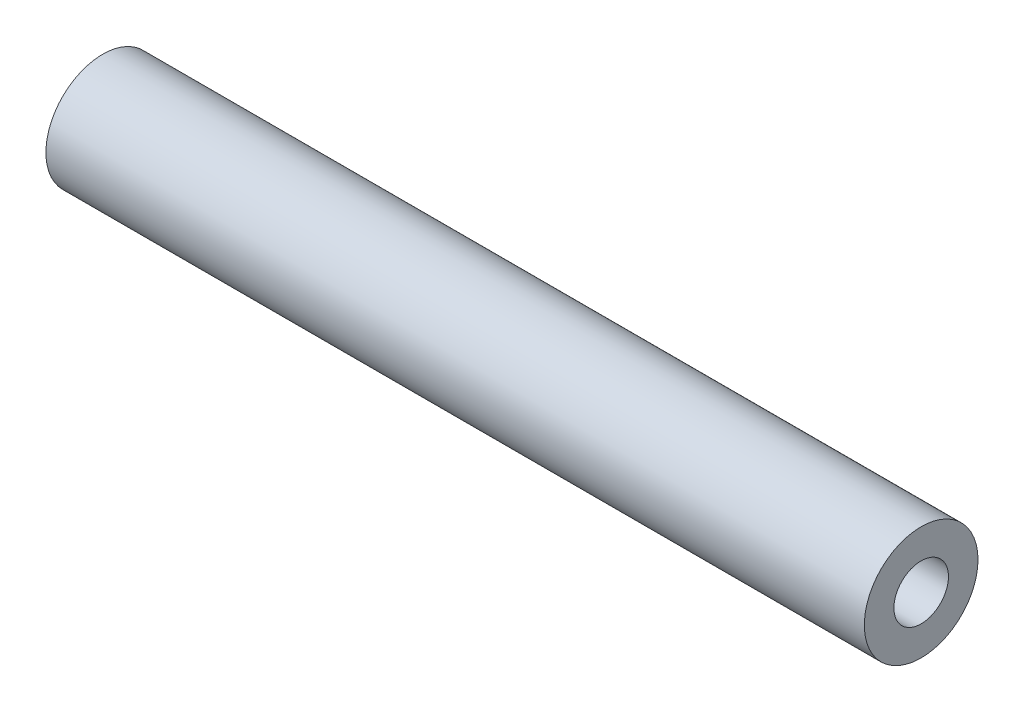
ISO-10303-21;
HEADER;
FILE_DESCRIPTION(('STEP AP214'),'2;1');
FILE_NAME('part.step','',(''),(''),'','','');
FILE_SCHEMA(('AUTOMOTIVE_DESIGN { 1 0 10303 214 1 1 1 1 }'));
ENDSEC;
DATA;
#1=APPLICATION_CONTEXT('core data for automotive mechanical design processes');
#2=APPLICATION_PROTOCOL_DEFINITION('international standard','automotive_design',2000,#1);
#3=PRODUCT_CONTEXT('',#1,'mechanical');
#4=PRODUCT('Part','Part','',(#3));
#5=PRODUCT_RELATED_PRODUCT_CATEGORY('part','',(#4));
#6=PRODUCT_DEFINITION_FORMATION('','',#4);
#7=PRODUCT_DEFINITION_CONTEXT('part definition',#1,'design');
#8=PRODUCT_DEFINITION('design','',#6,#7);
#9=PRODUCT_DEFINITION_SHAPE('','',#8);
#10=(LENGTH_UNIT() NAMED_UNIT(*) SI_UNIT(.MILLI.,.METRE.));
#11=(NAMED_UNIT(*) PLANE_ANGLE_UNIT() SI_UNIT($,.RADIAN.));
#12=(NAMED_UNIT(*) SI_UNIT($,.STERADIAN.) SOLID_ANGLE_UNIT());
#13=UNCERTAINTY_MEASURE_WITH_UNIT(LENGTH_MEASURE(1.E-05),#10,'distance_accuracy_value','');
#14=(GEOMETRIC_REPRESENTATION_CONTEXT(3) GLOBAL_UNCERTAINTY_ASSIGNED_CONTEXT((#13)) GLOBAL_UNIT_ASSIGNED_CONTEXT((#10,
#11,#12)) REPRESENTATION_CONTEXT('',''));
#15=CARTESIAN_POINT('',(0.,0.,0.));
#16=DIRECTION('',(0.,0.,1.));
#17=DIRECTION('',(1.,0.,0.));
#18=AXIS2_PLACEMENT_3D('',#15,#16,#17);
#19=CARTESIAN_POINT('',(90.,0.,0.));
#20=DIRECTION('',(-1.,0.,0.));
#21=DIRECTION('',(0.,0.,1.));
#22=AXIS2_PLACEMENT_3D('',#19,#20,#21);
#23=CYLINDRICAL_SURFACE('',#22,12.5);
#24=CARTESIAN_POINT('',(-21.5,-12.5,0.));
#25=CARTESIAN_POINT('',(-21.4999964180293,-12.499998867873,0.0839320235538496));
#26=CARTESIAN_POINT('',(-21.4929316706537,-12.4991457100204,0.167917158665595));
#27=CARTESIAN_POINT('',(-21.4648594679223,-12.495824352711,0.333552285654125));
#28=CARTESIAN_POINT('',(-21.4438372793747,-12.4933544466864,0.415199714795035));
#29=CARTESIAN_POINT('',(-21.388476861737,-12.4870779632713,0.573737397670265));
#30=CARTESIAN_POINT('',(-21.3541473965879,-12.4832722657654,0.650630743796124));
#31=CARTESIAN_POINT('',(-21.2731656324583,-12.4747479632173,0.797549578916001));
#32=CARTESIAN_POINT('',(-21.2265155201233,-12.4700295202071,0.86757628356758));
#33=CARTESIAN_POINT('',(-21.1219625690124,-12.460180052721,0.999145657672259));
#34=CARTESIAN_POINT('',(-21.064009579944,-12.4550472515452,1.0606483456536));
#35=CARTESIAN_POINT('',(-20.938603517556,-12.4449619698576,1.17307965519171));
#36=CARTESIAN_POINT('',(-20.8711499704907,-12.4400094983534,1.22400774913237));
#37=CARTESIAN_POINT('',(-20.7283995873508,-12.4308280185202,1.31399171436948));
#38=CARTESIAN_POINT('',(-20.6530791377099,-12.4266012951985,1.35301037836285));
#39=CARTESIAN_POINT('',(-20.4968956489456,-12.4193730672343,1.4178302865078));
#40=CARTESIAN_POINT('',(-20.4160328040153,-12.4163715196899,1.44363199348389));
#41=CARTESIAN_POINT('',(-20.2514735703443,-12.4119503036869,1.481164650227));
#42=CARTESIAN_POINT('',(-20.1677927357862,-12.4105230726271,1.49296288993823));
#43=CARTESIAN_POINT('',(-19.9996275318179,-12.4093888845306,1.50236187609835));
#44=CARTESIAN_POINT('',(-19.9151431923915,-12.4096818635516,1.49996315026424));
#45=CARTESIAN_POINT('',(-19.7482370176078,-12.4119480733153,1.48109158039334));
#46=CARTESIAN_POINT('',(-19.6658066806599,-12.4139124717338,1.46469271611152));
#47=CARTESIAN_POINT('',(-19.5048764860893,-12.4192864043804,1.41840173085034));
#48=CARTESIAN_POINT('',(-19.4263767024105,-12.4226959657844,1.38850935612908));
#49=CARTESIAN_POINT('',(-19.2753052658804,-12.4305861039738,1.31599990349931));
#50=CARTESIAN_POINT('',(-19.2027492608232,-12.4350693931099,1.27335053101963));
#51=CARTESIAN_POINT('',(-19.0657963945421,-12.444599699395,1.17656086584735));
#52=CARTESIAN_POINT('',(-19.0013998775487,-12.4496467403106,1.12242008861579));
#53=CARTESIAN_POINT('',(-18.8821644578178,-12.4597751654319,1.0037737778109));
#54=CARTESIAN_POINT('',(-18.8273890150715,-12.464856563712,0.93920445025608));
#55=CARTESIAN_POINT('',(-18.7294442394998,-12.4744510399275,0.801753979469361));
#56=CARTESIAN_POINT('',(-18.6862749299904,-12.478964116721,0.728872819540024));
#57=CARTESIAN_POINT('',(-18.6127683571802,-12.4869159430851,0.576819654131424));
#58=CARTESIAN_POINT('',(-18.5824349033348,-12.4903543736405,0.497645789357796));
#59=CARTESIAN_POINT('',(-18.5355106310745,-12.4957665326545,0.335278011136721));
#60=CARTESIAN_POINT('',(-18.5189192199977,-12.4977403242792,0.252084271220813));
#61=CARTESIAN_POINT('',(-18.5000318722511,-12.4999926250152,0.0845871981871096));
#62=CARTESIAN_POINT('',(-18.4976484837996,-12.5002815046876,0.000293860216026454));
#63=CARTESIAN_POINT('',(-18.5070142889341,-12.4991593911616,-0.16749103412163));
#64=CARTESIAN_POINT('',(-18.5187632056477,-12.4977484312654,-0.250982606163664));
#65=CARTESIAN_POINT('',(-18.5559874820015,-12.4933916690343,-0.414537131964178));
#66=CARTESIAN_POINT('',(-18.581421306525,-12.4904505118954,-0.494609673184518));
#67=CARTESIAN_POINT('',(-18.6452503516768,-12.4833627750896,-0.649352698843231));
#68=CARTESIAN_POINT('',(-18.683645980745,-12.4792161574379,-0.724023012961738));
#69=CARTESIAN_POINT('',(-18.7725214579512,-12.4701542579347,-0.866233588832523));
#70=CARTESIAN_POINT('',(-18.8230580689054,-12.4652354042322,-0.933738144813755));
#71=CARTESIAN_POINT('',(-18.9347004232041,-12.455190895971,-1.05933812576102));
#72=CARTESIAN_POINT('',(-18.995806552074,-12.4500652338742,-1.11743320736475));
#73=CARTESIAN_POINT('',(-19.1272378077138,-12.4401529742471,-1.22287397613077));
#74=CARTESIAN_POINT('',(-19.1976095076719,-12.4353682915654,-1.2701618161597));
#75=CARTESIAN_POINT('',(-19.3453475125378,-12.4267107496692,-1.35224657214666));
#76=CARTESIAN_POINT('',(-19.4227136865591,-12.4228378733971,-1.38704372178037));
#77=CARTESIAN_POINT('',(-19.5820553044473,-12.4164552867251,-1.4430649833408));
#78=CARTESIAN_POINT('',(-19.6640190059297,-12.4139422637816,-1.46432210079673));
#79=CARTESIAN_POINT('',(-19.8303844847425,-12.4105542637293,-1.49276636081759));
#80=CARTESIAN_POINT('',(-19.9147861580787,-12.4096792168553,-1.49995410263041));
#81=CARTESIAN_POINT('',(-20.0830563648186,-12.4096681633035,-1.50004516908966));
#82=CARTESIAN_POINT('',(-20.1669248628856,-12.4105210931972,-1.49303936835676));
#83=CARTESIAN_POINT('',(-20.3322833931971,-12.4138461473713,-1.46513424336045));
#84=CARTESIAN_POINT('',(-20.4137734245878,-12.4163182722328,-1.44423491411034));
#85=CARTESIAN_POINT('',(-20.5720522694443,-12.4225998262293,-1.38916369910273));
#86=CARTESIAN_POINT('',(-20.6488424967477,-12.4264088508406,-1.3549958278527));
#87=CARTESIAN_POINT('',(-20.795613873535,-12.4349357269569,-1.27436641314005));
#88=CARTESIAN_POINT('',(-20.8655949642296,-12.4396535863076,-1.22790476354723));
#89=CARTESIAN_POINT('',(-20.9972264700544,-12.4495027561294,-1.12366844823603));
#90=CARTESIAN_POINT('',(-21.0588230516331,-12.4546364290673,-1.06582601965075));
#91=CARTESIAN_POINT('',(-21.171471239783,-12.4647177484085,-0.940610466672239));
#92=CARTESIAN_POINT('',(-21.2225203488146,-12.4696653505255,-0.873235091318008));
#93=CARTESIAN_POINT('',(-21.3127752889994,-12.4788360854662,-0.730596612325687));
#94=CARTESIAN_POINT('',(-21.3519388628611,-12.4830566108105,-0.65530661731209));
#95=CARTESIAN_POINT('',(-21.4170118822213,-12.4902709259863,-0.499211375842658));
#96=CARTESIAN_POINT('',(-21.4429358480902,-12.4932660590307,-0.418412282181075));
#97=CARTESIAN_POINT('',(-21.4745317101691,-12.4969634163,-0.280988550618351));
#98=CARTESIAN_POINT('',(-21.4840687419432,-12.4980966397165,-0.225233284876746));
#99=CARTESIAN_POINT('',(-21.4968040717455,-12.4996153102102,-0.112993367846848));
#100=CARTESIAN_POINT('',(-21.5000024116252,-12.5000007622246,-0.0565087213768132));
#101=CARTESIAN_POINT('',(-21.5,-12.5,0.));
#102=B_SPLINE_CURVE_WITH_KNOTS('',3,(#24,#25,#26,#27,#28,#29,#30,#31,#32,#33,#34,#35,#36,#37,
#38,#39,#40,#41,#42,#43,#44,#45,#46,#47,#48,#49,#50,#51,#52,#53,#54,#55,#56,#57,#58,#59,#60,#61,
#62,#63,#64,#65,#66,#67,#68,#69,#70,#71,#72,#73,#74,#75,#76,#77,#78,#79,#80,#81,#82,#83,#84,#85,
#86,#87,#88,#89,#90,#91,#92,#93,#94,#95,#96,#97,#98,#99,#100,#101),.UNSPECIFIED.,.T.,.F.,(4,2,2,
2,2,2,2,2,2,2,2,2,2,2,2,2,2,2,2,2,2,2,2,2,2,2,2,2,2,2,2,2,2,2,2,2,2,2,4),(0.,0.25158967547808,
0.503445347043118,0.755135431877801,1.00678087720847,1.25956936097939,1.51237045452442,
1.76595344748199,2.01952755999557,2.2718781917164,2.5242194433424,2.77523546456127,
3.02625620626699,3.27791786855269,3.52959014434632,3.7828647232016,4.03613981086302,
4.2894900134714,4.54282928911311,4.79460761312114,5.04638100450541,5.29739451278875,
5.54841593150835,5.80063460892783,6.05286248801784,6.3064103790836,6.55995352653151,
6.81287624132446,7.06578818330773,7.31708596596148,7.56838383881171,7.81960573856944,
8.07082980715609,8.32359762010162,8.57642521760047,8.83014145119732,9.08357882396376,
9.25296714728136,9.42235435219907),.UNSPECIFIED.);
#103=CARTESIAN_POINT('',(-21.5,-12.5,0.));
#104=VERTEX_POINT('',#103);
#105=EDGE_CURVE('E74',#104,#104,#102,.T.);
#106=ORIENTED_EDGE('',*,*,#105,.T.);
#107=EDGE_LOOP('',(#106));
#108=FACE_BOUND('',#107,.T.);
#109=CARTESIAN_POINT('',(90.,0.,0.));
#110=DIRECTION('',(1.,0.,0.));
#111=DIRECTION('',(0.,0.,-1.));
#112=AXIS2_PLACEMENT_3D('',#109,#110,#111);
#113=CIRCLE('',#112,12.5);
#114=CARTESIAN_POINT('',(90.,0.,-12.5));
#115=VERTEX_POINT('',#114);
#116=EDGE_CURVE('E54',#115,#115,#113,.T.);
#117=ORIENTED_EDGE('',*,*,#116,.F.);
#118=EDGE_LOOP('',(#117));
#119=FACE_BOUND('',#118,.T.);
#120=CARTESIAN_POINT('',(-90.,0.,0.));
#121=DIRECTION('',(1.,0.,0.));
#122=DIRECTION('',(0.,0.,-1.));
#123=AXIS2_PLACEMENT_3D('',#120,#121,#122);
#124=CIRCLE('',#123,12.5);
#125=CARTESIAN_POINT('',(-90.,0.,-12.5));
#126=VERTEX_POINT('',#125);
#127=EDGE_CURVE('E79',#126,#126,#124,.T.);
#128=ORIENTED_EDGE('',*,*,#127,.T.);
#129=EDGE_LOOP('',(#128));
#130=FACE_BOUND('',#129,.T.);
#131=ADVANCED_FACE('F30',(#108,#119,#130),#23,.T.);
#132=CARTESIAN_POINT('',(90.,0.,0.));
#133=DIRECTION('',(1.,0.,0.));
#134=DIRECTION('',(0.,0.,-1.));
#135=AXIS2_PLACEMENT_3D('',#132,#133,#134);
#136=PLANE('',#135);
#137=CARTESIAN_POINT('',(90.,0.,0.));
#138=DIRECTION('',(1.,0.,0.));
#139=DIRECTION('',(0.,0.,-1.));
#140=AXIS2_PLACEMENT_3D('',#137,#138,#139);
#141=CIRCLE('',#140,6.);
#142=CARTESIAN_POINT('',(90.,0.,-6.));
#143=VERTEX_POINT('',#142);
#144=EDGE_CURVE('E94',#143,#143,#141,.T.);
#145=ORIENTED_EDGE('',*,*,#144,.F.);
#146=EDGE_LOOP('',(#145));
#147=FACE_BOUND('',#146,.T.);
#148=ORIENTED_EDGE('',*,*,#116,.T.);
#149=EDGE_LOOP('',(#148));
#150=FACE_BOUND('',#149,.T.);
#151=ADVANCED_FACE('F143',(#147,#150),#136,.T.);
#152=CARTESIAN_POINT('',(-90.,0.,0.));
#153=DIRECTION('',(1.,0.,0.));
#154=DIRECTION('',(0.,0.,-1.));
#155=AXIS2_PLACEMENT_3D('',#152,#153,#154);
#156=PLANE('',#155);
#157=CARTESIAN_POINT('',(-90.,0.,0.));
#158=DIRECTION('',(-1.,0.,0.));
#159=DIRECTION('',(0.,0.,1.));
#160=AXIS2_PLACEMENT_3D('',#157,#158,#159);
#161=CIRCLE('',#160,6.);
#162=CARTESIAN_POINT('',(-90.,0.,6.));
#163=VERTEX_POINT('',#162);
#164=EDGE_CURVE('E82',#163,#163,#161,.T.);
#165=ORIENTED_EDGE('',*,*,#164,.F.);
#166=EDGE_LOOP('',(#165));
#167=FACE_BOUND('',#166,.T.);
#168=ORIENTED_EDGE('',*,*,#127,.F.);
#169=EDGE_LOOP('',(#168));
#170=FACE_BOUND('',#169,.T.);
#171=ADVANCED_FACE('F140',(#167,#170),#156,.F.);
#172=CARTESIAN_POINT('',(-90.,0.,0.));
#173=DIRECTION('',(-1.,0.,0.));
#174=DIRECTION('',(0.,0.,1.));
#175=AXIS2_PLACEMENT_3D('',#172,#173,#174);
#176=CYLINDRICAL_SURFACE('',#175,6.);
#177=CARTESIAN_POINT('',(-60.,0.,0.));
#178=DIRECTION('',(-1.,0.,0.));
#179=DIRECTION('',(0.,0.,1.));
#180=AXIS2_PLACEMENT_3D('',#177,#178,#179);
#181=CIRCLE('',#180,5.99999999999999);
#182=CARTESIAN_POINT('',(-60.,0.,5.99999999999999));
#183=VERTEX_POINT('',#182);
#184=EDGE_CURVE('E85',#183,#183,#181,.T.);
#185=ORIENTED_EDGE('',*,*,#184,.F.);
#186=EDGE_LOOP('',(#185));
#187=FACE_BOUND('',#186,.T.);
#188=ORIENTED_EDGE('',*,*,#164,.T.);
#189=EDGE_LOOP('',(#188));
#190=FACE_BOUND('',#189,.T.);
#191=ADVANCED_FACE('F136',(#187,#190),#176,.F.);
#192=CARTESIAN_POINT('',(-60.,5.39999999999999,0.));
#193=DIRECTION('',(1.,0.,0.));
#194=DIRECTION('',(0.,0.,-1.));
#195=AXIS2_PLACEMENT_3D('',#192,#193,#194);
#196=PLANE('',#195);
#197=CARTESIAN_POINT('',(-60.,0.,0.));
#198=DIRECTION('',(-1.,0.,0.));
#199=DIRECTION('',(0.,0.,1.));
#200=AXIS2_PLACEMENT_3D('',#197,#198,#199);
#201=CIRCLE('',#200,5.39999999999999);
#202=CARTESIAN_POINT('',(-60.,0.,5.39999999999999));
#203=VERTEX_POINT('',#202);
#204=EDGE_CURVE('E88',#203,#203,#201,.T.);
#205=ORIENTED_EDGE('',*,*,#204,.F.);
#206=EDGE_LOOP('',(#205));
#207=FACE_BOUND('',#206,.T.);
#208=ORIENTED_EDGE('',*,*,#184,.T.);
#209=EDGE_LOOP('',(#208));
#210=FACE_BOUND('',#209,.T.);
#211=ADVANCED_FACE('F132',(#207,#210),#196,.F.);
#212=CARTESIAN_POINT('',(-90.,0.,0.));
#213=DIRECTION('',(-1.,0.,0.));
#214=DIRECTION('',(0.,0.,1.));
#215=AXIS2_PLACEMENT_3D('',#212,#213,#214);
#216=CYLINDRICAL_SURFACE('',#215,5.39999999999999);
#217=CARTESIAN_POINT('',(-56.25,0.,0.));
#218=DIRECTION('',(-1.,0.,0.));
#219=DIRECTION('',(0.,0.,1.));
#220=AXIS2_PLACEMENT_3D('',#217,#218,#219);
#221=CIRCLE('',#220,5.39999999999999);
#222=CARTESIAN_POINT('',(-56.25,0.,5.39999999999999));
#223=VERTEX_POINT('',#222);
#224=EDGE_CURVE('E91',#223,#223,#221,.T.);
#225=ORIENTED_EDGE('',*,*,#224,.F.);
#226=EDGE_LOOP('',(#225));
#227=FACE_BOUND('',#226,.T.);
#228=ORIENTED_EDGE('',*,*,#204,.T.);
#229=EDGE_LOOP('',(#228));
#230=FACE_BOUND('',#229,.T.);
#231=ADVANCED_FACE('F129',(#227,#230),#216,.F.);
#232=CARTESIAN_POINT('',(-56.25,0.,0.));
#233=DIRECTION('',(-1.,0.,0.));
#234=DIRECTION('',(0.,0.,1.));
#235=AXIS2_PLACEMENT_3D('',#232,#233,#234);
#236=CONICAL_SURFACE('',#235,5.39999999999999,1.02974425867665);
#237=CARTESIAN_POINT('',(-53.9066435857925,0.,0.));
#238=DIRECTION('',(-1.,0.,0.));
#239=DIRECTION('',(0.,0.,1.));
#240=AXIS2_PLACEMENT_3D('',#237,#238,#239);
#241=CIRCLE('',#240,1.49999999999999);
#242=CARTESIAN_POINT('',(-53.9066435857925,0.,1.49999999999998));
#243=VERTEX_POINT('',#242);
#244=EDGE_CURVE('E67',#243,#243,#241,.F.);
#245=CARTESIAN_POINT('',(-53.9066435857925,0.,1.49999999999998));
#246=CARTESIAN_POINT('',(-53.9310535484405,0.,1.54062499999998));
#247=CARTESIAN_POINT('',(-53.9554635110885,0.,1.58124999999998));
#248=CARTESIAN_POINT('',(-54.0042834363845,0.,1.66249999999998));
#249=CARTESIAN_POINT('',(-54.0286933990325,0.,1.70312499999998));
#250=CARTESIAN_POINT('',(-54.0775133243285,0.,1.78437499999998));
#251=CARTESIAN_POINT('',(-54.1019232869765,0.,1.82499999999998));
#252=CARTESIAN_POINT('',(-54.1507432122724,0.,1.90624999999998));
#253=CARTESIAN_POINT('',(-54.1751531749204,0.,1.94687499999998));
#254=CARTESIAN_POINT('',(-54.2239731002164,0.,2.02812499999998));
#255=CARTESIAN_POINT('',(-54.2483830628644,0.,2.06874999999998));
#256=CARTESIAN_POINT('',(-54.2972029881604,0.,2.14999999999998));
#257=CARTESIAN_POINT('',(-54.3216129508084,0.,2.19062499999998));
#258=CARTESIAN_POINT('',(-54.3704328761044,0.,2.27187499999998));
#259=CARTESIAN_POINT('',(-54.3948428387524,0.,2.31249999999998));
#260=CARTESIAN_POINT('',(-54.4436627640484,0.,2.39374999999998));
#261=CARTESIAN_POINT('',(-54.4680727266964,0.,2.43437499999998));
#262=CARTESIAN_POINT('',(-54.5168926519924,0.,2.51562499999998));
#263=CARTESIAN_POINT('',(-54.5413026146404,0.,2.55624999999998));
#264=CARTESIAN_POINT('',(-54.5901225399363,0.,2.63749999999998));
#265=CARTESIAN_POINT('',(-54.6145325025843,0.,2.67812499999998));
#266=CARTESIAN_POINT('',(-54.6633524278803,0.,2.75937499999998));
#267=CARTESIAN_POINT('',(-54.6877623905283,0.,2.79999999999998));
#268=CARTESIAN_POINT('',(-54.7365823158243,0.,2.88124999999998));
#269=CARTESIAN_POINT('',(-54.7609922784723,0.,2.92187499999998));
#270=CARTESIAN_POINT('',(-54.8098122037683,0.,3.00312499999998));
#271=CARTESIAN_POINT('',(-54.8342221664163,0.,3.04374999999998));
#272=CARTESIAN_POINT('',(-54.8830420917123,0.,3.12499999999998));
#273=CARTESIAN_POINT('',(-54.9074520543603,0.,3.16562499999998));
#274=CARTESIAN_POINT('',(-54.9562719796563,0.,3.24687499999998));
#275=CARTESIAN_POINT('',(-54.9806819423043,0.,3.28749999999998));
#276=CARTESIAN_POINT('',(-55.0295018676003,0.,3.36874999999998));
#277=CARTESIAN_POINT('',(-55.0539118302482,0.,3.40937499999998));
#278=CARTESIAN_POINT('',(-55.1027317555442,0.,3.49062499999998));
#279=CARTESIAN_POINT('',(-55.1271417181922,0.,3.53124999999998));
#280=CARTESIAN_POINT('',(-55.1759616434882,0.,3.61249999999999));
#281=CARTESIAN_POINT('',(-55.2003716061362,0.,3.65312499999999));
#282=CARTESIAN_POINT('',(-55.2491915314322,0.,3.73437499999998));
#283=CARTESIAN_POINT('',(-55.2736014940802,0.,3.77499999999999));
#284=CARTESIAN_POINT('',(-55.3224214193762,0.,3.85624999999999));
#285=CARTESIAN_POINT('',(-55.3468313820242,0.,3.89687499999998));
#286=CARTESIAN_POINT('',(-55.3956513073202,0.,3.97812499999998));
#287=CARTESIAN_POINT('',(-55.4200612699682,0.,4.01874999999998));
#288=CARTESIAN_POINT('',(-55.4688811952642,0.,4.09999999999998));
#289=CARTESIAN_POINT('',(-55.4932911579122,0.,4.14062499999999));
#290=CARTESIAN_POINT('',(-55.5421110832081,0.,4.22187499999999));
#291=CARTESIAN_POINT('',(-55.5665210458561,0.,4.26249999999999));
#292=CARTESIAN_POINT('',(-55.6153409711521,0.,4.34374999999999));
#293=CARTESIAN_POINT('',(-55.6397509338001,0.,4.38437499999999));
#294=CARTESIAN_POINT('',(-55.6885708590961,0.,4.46562499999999));
#295=CARTESIAN_POINT('',(-55.7129808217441,0.,4.50624999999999));
#296=CARTESIAN_POINT('',(-55.7618007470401,0.,4.58749999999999));
#297=CARTESIAN_POINT('',(-55.7862107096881,0.,4.62812499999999));
#298=CARTESIAN_POINT('',(-55.8350306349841,0.,4.70937499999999));
#299=CARTESIAN_POINT('',(-55.8594405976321,0.,4.74999999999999));
#300=CARTESIAN_POINT('',(-55.9082605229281,0.,4.83124999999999));
#301=CARTESIAN_POINT('',(-55.9326704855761,0.,4.87187499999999));
#302=CARTESIAN_POINT('',(-55.981490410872,0.,4.95312499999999));
#303=CARTESIAN_POINT('',(-56.00590037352,0.,4.99374999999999));
#304=CARTESIAN_POINT('',(-56.054720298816,0.,5.07499999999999));
#305=CARTESIAN_POINT('',(-56.079130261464,0.,5.11562499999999));
#306=CARTESIAN_POINT('',(-56.12795018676,0.,5.19687499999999));
#307=CARTESIAN_POINT('',(-56.152360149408,0.,5.23749999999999));
#308=CARTESIAN_POINT('',(-56.201180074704,0.,5.31874999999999));
#309=CARTESIAN_POINT('',(-56.225590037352,0.,5.35937499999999));
#310=CARTESIAN_POINT('',(-56.25,0.,5.39999999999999));
#311=B_SPLINE_CURVE_WITH_KNOTS('',3,(#245,#246,#247,#248,#249,#250,#251,#252,#253,#254,#255,
#256,#257,#258,#259,#260,#261,#262,#263,#264,#265,#266,#267,#268,#269,#270,#271,#272,#273,#274,
#275,#276,#277,#278,#279,#280,#281,#282,#283,#284,#285,#286,#287,#288,#289,#290,#291,#292,#293,
#294,#295,#296,#297,#298,#299,#300,#301,#302,#303,#304,#305,#306,#307,#308,#309,#310),
.UNSPECIFIED.,.F.,.F.,(4,2,2,2,2,2,2,2,2,2,2,2,2,2,2,2,2,2,2,2,2,2,2,2,2,2,2,2,2,2,2,2,4),(0.,
0.142183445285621,0.28436689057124,0.426550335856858,0.568733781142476,0.710917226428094,
0.853100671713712,0.995284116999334,1.13746756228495,1.27965100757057,1.42183445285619,
1.56401789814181,1.70620134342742,1.84838478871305,1.99056823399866,2.13275167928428,
2.2749351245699,2.41711856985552,2.55930201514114,2.70148546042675,2.84366890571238,
2.98585235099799,3.12803579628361,3.27021924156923,3.41240268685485,3.55458613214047,
3.69676957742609,3.83895302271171,3.98113646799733,4.12331991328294,4.26550335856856,
4.40768680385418,4.5498702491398),.UNSPECIFIED.);
#312=EDGE_CURVE('BSEAM125',#243,#223,#311,.T.);
#313=ORIENTED_EDGE('',*,*,#244,.T.);
#314=ORIENTED_EDGE('',*,*,#224,.T.);
#315=ORIENTED_EDGE('',*,*,#312,.T.);
#316=ORIENTED_EDGE('',*,*,#312,.F.);
#317=EDGE_LOOP('',(#313,#315,#314,#316));
#318=FACE_BOUND('',#317,.T.);
#319=ADVANCED_FACE('F125',(#318),#236,.F.);
#320=CARTESIAN_POINT('',(90.,0.,0.));
#321=DIRECTION('',(1.,0.,0.));
#322=DIRECTION('',(0.,0.,-1.));
#323=AXIS2_PLACEMENT_3D('',#320,#321,#322);
#324=CYLINDRICAL_SURFACE('',#323,6.);
#325=CARTESIAN_POINT('',(60.,0.,0.));
#326=DIRECTION('',(1.,0.,0.));
#327=DIRECTION('',(0.,0.,-1.));
#328=AXIS2_PLACEMENT_3D('',#325,#326,#327);
#329=CIRCLE('',#328,5.99999999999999);
#330=CARTESIAN_POINT('',(60.,0.,-5.99999999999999));
#331=VERTEX_POINT('',#330);
#332=EDGE_CURVE('E97',#331,#331,#329,.T.);
#333=ORIENTED_EDGE('',*,*,#332,.F.);
#334=EDGE_LOOP('',(#333));
#335=FACE_BOUND('',#334,.T.);
#336=ORIENTED_EDGE('',*,*,#144,.T.);
#337=EDGE_LOOP('',(#336));
#338=FACE_BOUND('',#337,.T.);
#339=ADVANCED_FACE('F121',(#335,#338),#324,.F.);
#340=CARTESIAN_POINT('',(60.,5.39999999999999,0.));
#341=DIRECTION('',(-1.,0.,0.));
#342=DIRECTION('',(0.,0.,1.));
#343=AXIS2_PLACEMENT_3D('',#340,#341,#342);
#344=PLANE('',#343);
#345=CARTESIAN_POINT('',(60.,0.,0.));
#346=DIRECTION('',(1.,0.,0.));
#347=DIRECTION('',(0.,0.,-1.));
#348=AXIS2_PLACEMENT_3D('',#345,#346,#347);
#349=CIRCLE('',#348,5.39999999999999);
#350=CARTESIAN_POINT('',(60.,0.,-5.39999999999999));
#351=VERTEX_POINT('',#350);
#352=EDGE_CURVE('E72',#351,#351,#349,.T.);
#353=ORIENTED_EDGE('',*,*,#352,.F.);
#354=EDGE_LOOP('',(#353));
#355=FACE_BOUND('',#354,.T.);
#356=ORIENTED_EDGE('',*,*,#332,.T.);
#357=EDGE_LOOP('',(#356));
#358=FACE_BOUND('',#357,.T.);
#359=ADVANCED_FACE('F117',(#355,#358),#344,.F.);
#360=CARTESIAN_POINT('',(90.,0.,0.));
#361=DIRECTION('',(1.,0.,0.));
#362=DIRECTION('',(0.,0.,-1.));
#363=AXIS2_PLACEMENT_3D('',#360,#361,#362);
#364=CYLINDRICAL_SURFACE('',#363,5.39999999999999);
#365=CARTESIAN_POINT('',(56.25,0.,0.));
#366=DIRECTION('',(1.,0.,0.));
#367=DIRECTION('',(0.,0.,-1.));
#368=AXIS2_PLACEMENT_3D('',#365,#366,#367);
#369=CIRCLE('',#368,5.39999999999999);
#370=CARTESIAN_POINT('',(56.25,0.,-5.39999999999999));
#371=VERTEX_POINT('',#370);
#372=EDGE_CURVE('E69',#371,#371,#369,.T.);
#373=ORIENTED_EDGE('',*,*,#372,.F.);
#374=EDGE_LOOP('',(#373));
#375=FACE_BOUND('',#374,.T.);
#376=ORIENTED_EDGE('',*,*,#352,.T.);
#377=EDGE_LOOP('',(#376));
#378=FACE_BOUND('',#377,.T.);
#379=ADVANCED_FACE('F114',(#375,#378),#364,.F.);
#380=CARTESIAN_POINT('',(56.25,0.,0.));
#381=DIRECTION('',(1.,0.,0.));
#382=DIRECTION('',(0.,0.,-1.));
#383=AXIS2_PLACEMENT_3D('',#380,#381,#382);
#384=CONICAL_SURFACE('',#383,5.39999999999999,1.02974425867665);
#385=CARTESIAN_POINT('',(53.0053526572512,0.,0.));
#386=VERTEX_POINT('',#385);
#387=VERTEX_LOOP('',#386);
#388=FACE_BOUND('',#387,.T.);
#389=ORIENTED_EDGE('',*,*,#372,.T.);
#390=EDGE_LOOP('',(#389));
#391=FACE_BOUND('',#390,.T.);
#392=ADVANCED_FACE('F59',(#388,#391),#384,.F.);
#393=CARTESIAN_POINT('',(-90.,0.,0.));
#394=DIRECTION('',(-1.,0.,0.));
#395=DIRECTION('',(0.,0.,1.));
#396=AXIS2_PLACEMENT_3D('',#393,#394,#395);
#397=CYLINDRICAL_SURFACE('',#396,1.49999999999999);
#398=CARTESIAN_POINT('',(-20.,0.,0.));
#399=DIRECTION('',(-0.707106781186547,-0.707106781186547,0.));
#400=DIRECTION('',(-0.707106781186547,0.707106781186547,0.));
#401=AXIS2_PLACEMENT_3D('',#398,#399,#400);
#402=ELLIPSE('',#401,2.12132034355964,1.5);
#403=CARTESIAN_POINT('',(-20.,0.,-1.49999999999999));
#404=VERTEX_POINT('',#403);
#405=CARTESIAN_POINT('',(-20.,0.,1.49999999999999));
#406=VERTEX_POINT('',#405);
#407=EDGE_CURVE('E38',#404,#406,#402,.T.);
#408=ORIENTED_EDGE('',*,*,#407,.T.);
#409=CARTESIAN_POINT('',(-20.,0.,0.));
#410=DIRECTION('',(-0.707106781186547,0.707106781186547,0.));
#411=DIRECTION('',(-0.707106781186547,-0.707106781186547,0.));
#412=AXIS2_PLACEMENT_3D('',#409,#410,#411);
#413=ELLIPSE('',#412,2.12132034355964,1.5);
#414=EDGE_CURVE('E11',#406,#404,#413,.F.);
#415=ORIENTED_EDGE('',*,*,#414,.T.);
#416=EDGE_LOOP('',(#408,#415));
#417=FACE_BOUND('',#416,.T.);
#418=CARTESIAN_POINT('',(-18.,0.,0.));
#419=DIRECTION('',(-1.,0.,0.));
#420=DIRECTION('',(0.,0.,1.));
#421=AXIS2_PLACEMENT_3D('',#418,#419,#420);
#422=CIRCLE('',#421,1.49999999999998);
#423=CARTESIAN_POINT('',(-18.,0.,1.49999999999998));
#424=VERTEX_POINT('',#423);
#425=EDGE_CURVE('E64',#424,#424,#422,.T.);
#426=ORIENTED_EDGE('',*,*,#425,.F.);
#427=EDGE_LOOP('',(#426));
#428=FACE_BOUND('',#427,.T.);
#429=ORIENTED_EDGE('',*,*,#244,.F.);
#430=EDGE_LOOP('',(#429));
#431=FACE_BOUND('',#430,.T.);
#432=ADVANCED_FACE('F55',(#417,#428,#431),#397,.F.);
#433=CARTESIAN_POINT('',(-18.,0.,0.));
#434=DIRECTION('',(-1.,0.,0.));
#435=DIRECTION('',(0.,0.,1.));
#436=AXIS2_PLACEMENT_3D('',#433,#434,#435);
#437=CONICAL_SURFACE('',#436,1.49999999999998,1.02974425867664);
#438=CARTESIAN_POINT('',(-17.0987090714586,0.,0.));
#439=VERTEX_POINT('',#438);
#440=VERTEX_LOOP('',#439);
#441=FACE_BOUND('',#440,.T.);
#442=ORIENTED_EDGE('',*,*,#425,.T.);
#443=EDGE_LOOP('',(#442));
#444=FACE_BOUND('',#443,.T.);
#445=ADVANCED_FACE('F58',(#441,#444),#437,.F.);
#446=CARTESIAN_POINT('',(-20.,-12.5,0.));
#447=DIRECTION('',(0.,1.,0.));
#448=DIRECTION('',(0.,0.,1.));
#449=AXIS2_PLACEMENT_3D('',#446,#447,#448);
#450=CYLINDRICAL_SURFACE('',#449,1.5);
#451=ORIENTED_EDGE('',*,*,#407,.F.);
#452=ORIENTED_EDGE('',*,*,#414,.F.);
#453=EDGE_LOOP('',(#451,#452));
#454=FACE_BOUND('',#453,.T.);
#455=ORIENTED_EDGE('',*,*,#105,.F.);
#456=EDGE_LOOP('',(#455));
#457=FACE_BOUND('',#456,.T.);
#458=ADVANCED_FACE('F51',(#454,#457),#450,.F.);
#459=CLOSED_SHELL('',(#131,#151,#171,#191,#211,#231,#319,#339,#359,#379,#392,#432,#445,#458));
#460=MANIFOLD_SOLID_BREP('B2',#459);
#461=ADVANCED_BREP_SHAPE_REPRESENTATION('',(#18,#460),#14);
#462=SHAPE_DEFINITION_REPRESENTATION(#9,#461);
ENDSEC;
END-ISO-10303-21;
